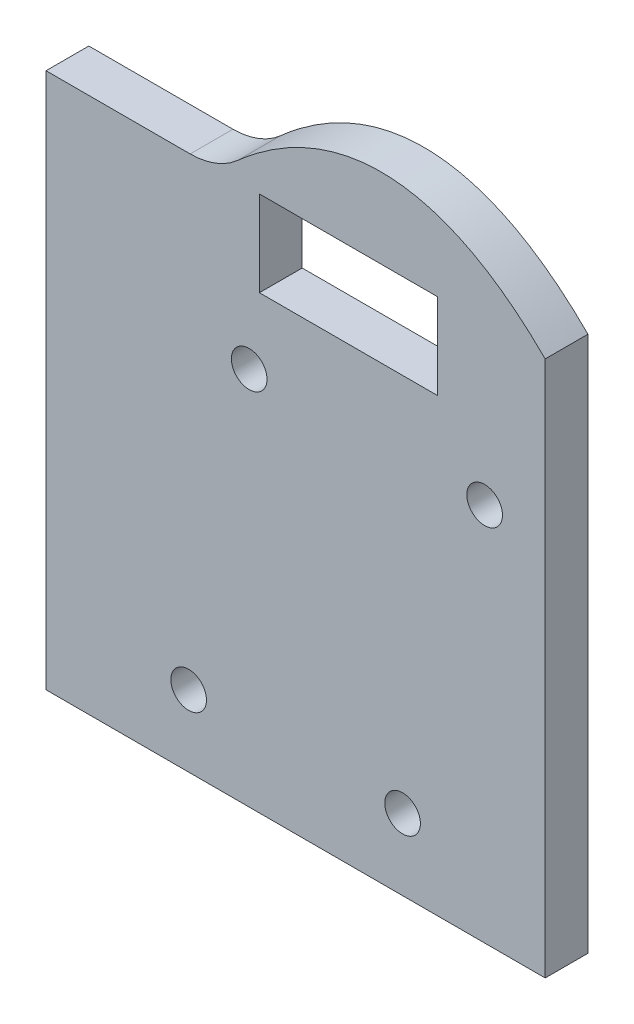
ISO-10303-21;
HEADER;
FILE_DESCRIPTION(('STEP AP214'),'2;1');
FILE_NAME('part.step','',(''),(''),'','','');
FILE_SCHEMA(('AUTOMOTIVE_DESIGN { 1 0 10303 214 1 1 1 1 }'));
ENDSEC;
DATA;
#1=APPLICATION_CONTEXT('core data for automotive mechanical design processes');
#2=APPLICATION_PROTOCOL_DEFINITION('international standard','automotive_design',2000,#1);
#3=PRODUCT_CONTEXT('',#1,'mechanical');
#4=PRODUCT('Part','Part','',(#3));
#5=PRODUCT_RELATED_PRODUCT_CATEGORY('part','',(#4));
#6=PRODUCT_DEFINITION_FORMATION('','',#4);
#7=PRODUCT_DEFINITION_CONTEXT('part definition',#1,'design');
#8=PRODUCT_DEFINITION('design','',#6,#7);
#9=PRODUCT_DEFINITION_SHAPE('','',#8);
#10=(LENGTH_UNIT() NAMED_UNIT(*) SI_UNIT(.MILLI.,.METRE.));
#11=(NAMED_UNIT(*) PLANE_ANGLE_UNIT() SI_UNIT($,.RADIAN.));
#12=(NAMED_UNIT(*) SI_UNIT($,.STERADIAN.) SOLID_ANGLE_UNIT());
#13=UNCERTAINTY_MEASURE_WITH_UNIT(LENGTH_MEASURE(1.E-05),#10,'distance_accuracy_value','');
#14=(GEOMETRIC_REPRESENTATION_CONTEXT(3) GLOBAL_UNCERTAINTY_ASSIGNED_CONTEXT((#13)) GLOBAL_UNIT_ASSIGNED_CONTEXT((#10,
#11,#12)) REPRESENTATION_CONTEXT('',''));
#15=CARTESIAN_POINT('',(0.,0.,0.));
#16=DIRECTION('',(0.,0.,1.));
#17=DIRECTION('',(1.,0.,0.));
#18=AXIS2_PLACEMENT_3D('',#15,#16,#17);
#19=CARTESIAN_POINT('',(-223.622738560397,79.0489904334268,6.));
#20=DIRECTION('',(0.,0.,1.));
#21=DIRECTION('',(1.,0.,0.));
#22=AXIS2_PLACEMENT_3D('',#19,#20,#21);
#23=PLANE('',#22);
#24=CARTESIAN_POINT('',(-243.480623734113,45.8964952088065,6.));
#25=DIRECTION('',(0.,0.,1.));
#26=DIRECTION('',(-1.,0.,0.));
#27=AXIS2_PLACEMENT_3D('',#24,#25,#26);
#28=CIRCLE('',#27,2.5);
#29=CARTESIAN_POINT('',(-245.980623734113,45.8964952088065,6.));
#30=VERTEX_POINT('',#29);
#31=EDGE_CURVE('E143',#30,#30,#28,.T.);
#32=ORIENTED_EDGE('',*,*,#31,.F.);
#33=EDGE_LOOP('',(#32));
#34=FACE_BOUND('',#33,.T.);
#35=CARTESIAN_POINT('',(-251.971314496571,2.69858037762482,6.));
#36=DIRECTION('',(0.,0.,1.));
#37=DIRECTION('',(-1.,0.,0.));
#38=AXIS2_PLACEMENT_3D('',#35,#36,#37);
#39=CIRCLE('',#38,2.49999999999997);
#40=CARTESIAN_POINT('',(-254.47131449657,2.69858037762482,6.));
#41=VERTEX_POINT('',#40);
#42=EDGE_CURVE('E155',#41,#41,#39,.T.);
#43=ORIENTED_EDGE('',*,*,#42,.F.);
#44=EDGE_LOOP('',(#43));
#45=FACE_BOUND('',#44,.T.);
#46=CARTESIAN_POINT('',(-201.971314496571,67.884414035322,6.));
#47=CARTESIAN_POINT('',(-216.079648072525,81.9598671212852,6.));
#48=CARTESIAN_POINT('',(-231.216121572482,82.7413645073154,6.));
#49=CARTESIAN_POINT('',(-245.123285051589,70.4038145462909,6.));
#50=B_SPLINE_CURVE_WITH_KNOTS('',3,(#46,#47,#48,#49),.UNSPECIFIED.,.F.,.F.,(4,4),
(0.0599123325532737,1.),.UNSPECIFIED.);
#51=CARTESIAN_POINT('',(-201.971314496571,67.884414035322,6.));
#52=VERTEX_POINT('',#51);
#53=CARTESIAN_POINT('',(-245.123285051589,70.4038145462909,6.));
#54=VERTEX_POINT('',#53);
#55=EDGE_CURVE('E166',#52,#54,#50,.T.);
#56=ORIENTED_EDGE('',*,*,#55,.T.);
#57=CARTESIAN_POINT('',(-251.759596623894,77.8844140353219,6.));
#58=DIRECTION('',(0.,0.,-1.));
#59=DIRECTION('',(-1.,0.,0.));
#60=AXIS2_PLACEMENT_3D('',#57,#58,#59);
#61=CIRCLE('',#60,9.99999999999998);
#62=CARTESIAN_POINT('',(-251.759596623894,67.8844140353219,6.));
#63=VERTEX_POINT('',#62);
#64=EDGE_CURVE('E172',#54,#63,#61,.T.);
#65=ORIENTED_EDGE('',*,*,#64,.T.);
#66=DIRECTION('',(-1.,0.,0.));
#67=VECTOR('',#66,1.);
#68=CARTESIAN_POINT('',(-271.971290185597,67.884414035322,6.));
#69=LINE('',#68,#67);
#70=CARTESIAN_POINT('',(-271.971290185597,67.884414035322,6.));
#71=VERTEX_POINT('',#70);
#72=EDGE_CURVE('E178',#63,#71,#69,.T.);
#73=ORIENTED_EDGE('',*,*,#72,.T.);
#74=DIRECTION('',(-6.32120893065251E-07,-0.9999999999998,0.));
#75=VECTOR('',#74,1.);
#76=CARTESIAN_POINT('',(-271.971337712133,-7.30141962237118,6.));
#77=LINE('',#76,#75);
#78=CARTESIAN_POINT('',(-271.971337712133,-7.30141962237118,6.));
#79=VERTEX_POINT('',#78);
#80=EDGE_CURVE('E180',#71,#79,#77,.T.);
#81=ORIENTED_EDGE('',*,*,#80,.T.);
#82=DIRECTION('',(1.,0.,0.));
#83=VECTOR('',#82,1.);
#84=CARTESIAN_POINT('',(-201.971314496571,-7.30141962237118,6.));
#85=LINE('',#84,#83);
#86=CARTESIAN_POINT('',(-201.971314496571,-7.30141962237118,6.));
#87=VERTEX_POINT('',#86);
#88=EDGE_CURVE('E182',#79,#87,#85,.T.);
#89=ORIENTED_EDGE('',*,*,#88,.T.);
#90=DIRECTION('',(0.,1.,0.));
#91=VECTOR('',#90,1.);
#92=CARTESIAN_POINT('',(-201.971314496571,67.884414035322,6.));
#93=LINE('',#92,#91);
#94=EDGE_CURVE('E184',#87,#52,#93,.T.);
#95=ORIENTED_EDGE('',*,*,#94,.T.);
#96=EDGE_LOOP('',(#56,#65,#73,#81,#89,#95));
#97=FACE_BOUND('',#96,.T.);
#98=CARTESIAN_POINT('',(-221.971337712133,2.69858037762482,6.));
#99=DIRECTION('',(0.,0.,1.));
#100=DIRECTION('',(1.,0.,0.));
#101=AXIS2_PLACEMENT_3D('',#98,#99,#100);
#102=CIRCLE('',#101,2.5);
#103=CARTESIAN_POINT('',(-219.471337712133,2.69858037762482,6.));
#104=VERTEX_POINT('',#103);
#105=EDGE_CURVE('E161',#104,#104,#102,.T.);
#106=ORIENTED_EDGE('',*,*,#105,.F.);
#107=EDGE_LOOP('',(#106));
#108=FACE_BOUND('',#107,.T.);
#109=CARTESIAN_POINT('',(-210.462051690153,45.8964952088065,6.));
#110=DIRECTION('',(0.,0.,1.));
#111=DIRECTION('',(1.,0.,0.));
#112=AXIS2_PLACEMENT_3D('',#109,#110,#111);
#113=CIRCLE('',#112,2.5);
#114=CARTESIAN_POINT('',(-207.962051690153,45.8964952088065,6.));
#115=VERTEX_POINT('',#114);
#116=EDGE_CURVE('E149',#115,#115,#113,.T.);
#117=ORIENTED_EDGE('',*,*,#116,.F.);
#118=EDGE_LOOP('',(#117));
#119=FACE_BOUND('',#118,.T.);
#120=DIRECTION('',(1.,0.,0.));
#121=VECTOR('',#120,1.);
#122=CARTESIAN_POINT('',(-217.044863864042,55.884414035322,6.));
#123=LINE('',#122,#121);
#124=CARTESIAN_POINT('',(-242.044855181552,55.884414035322,6.));
#125=VERTEX_POINT('',#124);
#126=CARTESIAN_POINT('',(-217.044863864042,55.884414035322,6.));
#127=VERTEX_POINT('',#126);
#128=EDGE_CURVE('E115',#125,#127,#123,.T.);
#129=ORIENTED_EDGE('',*,*,#128,.F.);
#130=DIRECTION('',(0.,-1.,0.));
#131=VECTOR('',#130,1.);
#132=CARTESIAN_POINT('',(-242.044855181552,55.884414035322,6.));
#133=LINE('',#132,#131);
#134=CARTESIAN_POINT('',(-242.044855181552,67.884414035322,6.));
#135=VERTEX_POINT('',#134);
#136=EDGE_CURVE('E107',#135,#125,#133,.T.);
#137=ORIENTED_EDGE('',*,*,#136,.F.);
#138=DIRECTION('',(-1.,0.,0.));
#139=VECTOR('',#138,1.);
#140=CARTESIAN_POINT('',(-242.044855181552,67.884414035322,6.));
#141=LINE('',#140,#139);
#142=CARTESIAN_POINT('',(-217.044863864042,67.884414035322,6.));
#143=VERTEX_POINT('',#142);
#144=EDGE_CURVE('E129',#143,#135,#141,.T.);
#145=ORIENTED_EDGE('',*,*,#144,.F.);
#146=DIRECTION('',(0.,1.,0.));
#147=VECTOR('',#146,1.);
#148=CARTESIAN_POINT('',(-217.044863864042,67.884414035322,6.));
#149=LINE('',#148,#147);
#150=EDGE_CURVE('E127',#127,#143,#149,.T.);
#151=ORIENTED_EDGE('',*,*,#150,.F.);
#152=EDGE_LOOP('',(#129,#137,#145,#151));
#153=FACE_BOUND('',#152,.T.);
#154=ADVANCED_FACE('F29',(#34,#45,#97,#108,#119,#153),#23,.T.);
#155=CARTESIAN_POINT('',(-223.622738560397,79.0489904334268,0.));
#156=DIRECTION('',(0.,0.,1.));
#157=DIRECTION('',(1.,0.,0.));
#158=AXIS2_PLACEMENT_3D('',#155,#156,#157);
#159=PLANE('',#158);
#160=CARTESIAN_POINT('',(-243.480623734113,45.8964952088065,0.));
#161=DIRECTION('',(0.,0.,1.));
#162=DIRECTION('',(-1.,0.,0.));
#163=AXIS2_PLACEMENT_3D('',#160,#161,#162);
#164=CIRCLE('',#163,2.5);
#165=CARTESIAN_POINT('',(-245.980623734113,45.8964952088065,0.));
#166=VERTEX_POINT('',#165);
#167=EDGE_CURVE('E123',#166,#166,#164,.T.);
#168=ORIENTED_EDGE('',*,*,#167,.T.);
#169=EDGE_LOOP('',(#168));
#170=FACE_BOUND('',#169,.T.);
#171=CARTESIAN_POINT('',(-251.971314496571,2.69858037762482,0.));
#172=DIRECTION('',(0.,0.,1.));
#173=DIRECTION('',(-1.,0.,0.));
#174=AXIS2_PLACEMENT_3D('',#171,#172,#173);
#175=CIRCLE('',#174,2.49999999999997);
#176=CARTESIAN_POINT('',(-254.47131449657,2.69858037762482,0.));
#177=VERTEX_POINT('',#176);
#178=EDGE_CURVE('E152',#177,#177,#175,.T.);
#179=ORIENTED_EDGE('',*,*,#178,.T.);
#180=EDGE_LOOP('',(#179));
#181=FACE_BOUND('',#180,.T.);
#182=CARTESIAN_POINT('',(-201.971314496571,67.884414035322,0.));
#183=CARTESIAN_POINT('',(-216.079648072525,81.9598671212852,0.));
#184=CARTESIAN_POINT('',(-231.216121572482,82.7413645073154,0.));
#185=CARTESIAN_POINT('',(-245.123285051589,70.4038145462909,0.));
#186=B_SPLINE_CURVE_WITH_KNOTS('',3,(#182,#183,#184,#185),.UNSPECIFIED.,.F.,.F.,(4,4),
(0.0599123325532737,1.),.UNSPECIFIED.);
#187=CARTESIAN_POINT('',(-201.971314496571,67.884414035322,0.));
#188=VERTEX_POINT('',#187);
#189=CARTESIAN_POINT('',(-245.123285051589,70.4038145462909,0.));
#190=VERTEX_POINT('',#189);
#191=EDGE_CURVE('E164',#188,#190,#186,.T.);
#192=ORIENTED_EDGE('',*,*,#191,.F.);
#193=DIRECTION('',(0.,1.,0.));
#194=VECTOR('',#193,1.);
#195=CARTESIAN_POINT('',(-201.971314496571,67.884414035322,0.));
#196=LINE('',#195,#194);
#197=CARTESIAN_POINT('',(-201.971314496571,-7.30141962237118,0.));
#198=VERTEX_POINT('',#197);
#199=EDGE_CURVE('E173',#198,#188,#196,.T.);
#200=ORIENTED_EDGE('',*,*,#199,.F.);
#201=DIRECTION('',(1.,0.,0.));
#202=VECTOR('',#201,1.);
#203=CARTESIAN_POINT('',(-201.971314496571,-7.30141962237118,0.));
#204=LINE('',#203,#202);
#205=CARTESIAN_POINT('',(-271.971337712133,-7.30141962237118,0.));
#206=VERTEX_POINT('',#205);
#207=EDGE_CURVE('E200',#206,#198,#204,.T.);
#208=ORIENTED_EDGE('',*,*,#207,.F.);
#209=DIRECTION('',(-6.32120893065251E-07,-0.9999999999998,0.));
#210=VECTOR('',#209,1.);
#211=CARTESIAN_POINT('',(-271.971337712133,-7.30141962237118,0.));
#212=LINE('',#211,#210);
#213=CARTESIAN_POINT('',(-271.971290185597,67.884414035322,0.));
#214=VERTEX_POINT('',#213);
#215=EDGE_CURVE('E198',#214,#206,#212,.T.);
#216=ORIENTED_EDGE('',*,*,#215,.F.);
#217=DIRECTION('',(-1.,0.,0.));
#218=VECTOR('',#217,1.);
#219=CARTESIAN_POINT('',(-271.971290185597,67.884414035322,0.));
#220=LINE('',#219,#218);
#221=CARTESIAN_POINT('',(-251.759596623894,67.8844140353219,0.));
#222=VERTEX_POINT('',#221);
#223=EDGE_CURVE('E196',#222,#214,#220,.T.);
#224=ORIENTED_EDGE('',*,*,#223,.F.);
#225=CARTESIAN_POINT('',(-251.759596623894,77.8844140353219,0.));
#226=DIRECTION('',(0.,0.,-1.));
#227=DIRECTION('',(-1.,0.,0.));
#228=AXIS2_PLACEMENT_3D('',#225,#226,#227);
#229=CIRCLE('',#228,9.99999999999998);
#230=EDGE_CURVE('E191',#190,#222,#229,.T.);
#231=ORIENTED_EDGE('',*,*,#230,.F.);
#232=EDGE_LOOP('',(#192,#200,#208,#216,#224,#231));
#233=FACE_BOUND('',#232,.T.);
#234=CARTESIAN_POINT('',(-221.971337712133,2.69858037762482,0.));
#235=DIRECTION('',(0.,0.,1.));
#236=DIRECTION('',(1.,0.,0.));
#237=AXIS2_PLACEMENT_3D('',#234,#235,#236);
#238=CIRCLE('',#237,2.5);
#239=CARTESIAN_POINT('',(-219.471337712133,2.69858037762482,0.));
#240=VERTEX_POINT('',#239);
#241=EDGE_CURVE('E158',#240,#240,#238,.T.);
#242=ORIENTED_EDGE('',*,*,#241,.T.);
#243=EDGE_LOOP('',(#242));
#244=FACE_BOUND('',#243,.T.);
#245=CARTESIAN_POINT('',(-210.462051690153,45.8964952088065,0.));
#246=DIRECTION('',(0.,0.,1.));
#247=DIRECTION('',(1.,0.,0.));
#248=AXIS2_PLACEMENT_3D('',#245,#246,#247);
#249=CIRCLE('',#248,2.5);
#250=CARTESIAN_POINT('',(-207.962051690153,45.8964952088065,0.));
#251=VERTEX_POINT('',#250);
#252=EDGE_CURVE('E146',#251,#251,#249,.T.);
#253=ORIENTED_EDGE('',*,*,#252,.T.);
#254=EDGE_LOOP('',(#253));
#255=FACE_BOUND('',#254,.T.);
#256=DIRECTION('',(0.,-1.,0.));
#257=VECTOR('',#256,1.);
#258=CARTESIAN_POINT('',(-242.044855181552,55.884414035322,0.));
#259=LINE('',#258,#257);
#260=CARTESIAN_POINT('',(-242.044855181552,67.884414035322,0.));
#261=VERTEX_POINT('',#260);
#262=CARTESIAN_POINT('',(-242.044855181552,55.884414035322,0.));
#263=VERTEX_POINT('',#262);
#264=EDGE_CURVE('E53',#261,#263,#259,.T.);
#265=ORIENTED_EDGE('',*,*,#264,.T.);
#266=DIRECTION('',(1.,0.,0.));
#267=VECTOR('',#266,1.);
#268=CARTESIAN_POINT('',(-217.044863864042,55.884414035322,0.));
#269=LINE('',#268,#267);
#270=CARTESIAN_POINT('',(-217.044863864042,55.884414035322,0.));
#271=VERTEX_POINT('',#270);
#272=EDGE_CURVE('E122',#263,#271,#269,.T.);
#273=ORIENTED_EDGE('',*,*,#272,.T.);
#274=DIRECTION('',(0.,1.,0.));
#275=VECTOR('',#274,1.);
#276=CARTESIAN_POINT('',(-217.044863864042,67.884414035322,0.));
#277=LINE('',#276,#275);
#278=CARTESIAN_POINT('',(-217.044863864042,67.884414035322,0.));
#279=VERTEX_POINT('',#278);
#280=EDGE_CURVE('E135',#271,#279,#277,.T.);
#281=ORIENTED_EDGE('',*,*,#280,.T.);
#282=DIRECTION('',(-1.,0.,0.));
#283=VECTOR('',#282,1.);
#284=CARTESIAN_POINT('',(-242.044855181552,67.884414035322,0.));
#285=LINE('',#284,#283);
#286=EDGE_CURVE('E116',#279,#261,#285,.T.);
#287=ORIENTED_EDGE('',*,*,#286,.T.);
#288=EDGE_LOOP('',(#265,#273,#281,#287));
#289=FACE_BOUND('',#288,.T.);
#290=ADVANCED_FACE('F224',(#170,#181,#233,#244,#255,#289),#159,.F.);
#291=DIRECTION('',(0.,0.,-1.));
#292=VECTOR('',#291,1.);
#293=SURFACE_OF_LINEAR_EXTRUSION('',#50,#292);
#294=ORIENTED_EDGE('',*,*,#191,.T.);
#295=DIRECTION('',(0.,0.,-1.));
#296=VECTOR('',#295,1.);
#297=CARTESIAN_POINT('',(-245.123285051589,70.4038145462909,6.));
#298=LINE('',#297,#296);
#299=EDGE_CURVE('E11',#54,#190,#298,.T.);
#300=ORIENTED_EDGE('',*,*,#299,.F.);
#301=ORIENTED_EDGE('',*,*,#55,.F.);
#302=DIRECTION('',(0.,0.,-1.));
#303=VECTOR('',#302,1.);
#304=CARTESIAN_POINT('',(-201.971314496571,67.884414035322,6.));
#305=LINE('',#304,#303);
#306=EDGE_CURVE('E186',#52,#188,#305,.T.);
#307=ORIENTED_EDGE('',*,*,#306,.T.);
#308=EDGE_LOOP('',(#294,#300,#301,#307));
#309=FACE_BOUND('',#308,.T.);
#310=ADVANCED_FACE('F31',(#309),#293,.F.);
#311=CARTESIAN_POINT('',(-251.759596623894,77.8844140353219,6.));
#312=DIRECTION('',(0.,0.,-1.));
#313=DIRECTION('',(-1.,0.,0.));
#314=AXIS2_PLACEMENT_3D('',#311,#312,#313);
#315=CYLINDRICAL_SURFACE('',#314,9.99999999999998);
#316=ORIENTED_EDGE('',*,*,#230,.T.);
#317=DIRECTION('',(0.,0.,-1.));
#318=VECTOR('',#317,1.);
#319=CARTESIAN_POINT('',(-251.759596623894,67.8844140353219,6.));
#320=LINE('',#319,#318);
#321=EDGE_CURVE('E38',#63,#222,#320,.T.);
#322=ORIENTED_EDGE('',*,*,#321,.F.);
#323=ORIENTED_EDGE('',*,*,#64,.F.);
#324=ORIENTED_EDGE('',*,*,#299,.T.);
#325=EDGE_LOOP('',(#316,#322,#323,#324));
#326=FACE_BOUND('',#325,.T.);
#327=ADVANCED_FACE('F242',(#326),#315,.F.);
#328=CARTESIAN_POINT('',(-271.971290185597,67.884414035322,6.));
#329=DIRECTION('',(0.,-1.,0.));
#330=DIRECTION('',(1.,0.,0.));
#331=AXIS2_PLACEMENT_3D('',#328,#329,#330);
#332=PLANE('',#331);
#333=ORIENTED_EDGE('',*,*,#223,.T.);
#334=DIRECTION('',(0.,0.,-1.));
#335=VECTOR('',#334,1.);
#336=CARTESIAN_POINT('',(-271.971290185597,67.884414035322,6.));
#337=LINE('',#336,#335);
#338=EDGE_CURVE('E211',#71,#214,#337,.T.);
#339=ORIENTED_EDGE('',*,*,#338,.F.);
#340=ORIENTED_EDGE('',*,*,#72,.F.);
#341=ORIENTED_EDGE('',*,*,#321,.T.);
#342=EDGE_LOOP('',(#333,#339,#340,#341));
#343=FACE_BOUND('',#342,.T.);
#344=ADVANCED_FACE('F218',(#343),#332,.F.);
#345=CARTESIAN_POINT('',(-271.971337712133,-7.30141962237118,6.));
#346=DIRECTION('',(0.9999999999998,-6.32120893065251E-07,0.));
#347=DIRECTION('',(6.32120893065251E-07,0.9999999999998,0.));
#348=AXIS2_PLACEMENT_3D('',#345,#346,#347);
#349=PLANE('',#348);
#350=ORIENTED_EDGE('',*,*,#215,.T.);
#351=DIRECTION('',(0.,0.,-1.));
#352=VECTOR('',#351,1.);
#353=CARTESIAN_POINT('',(-271.971337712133,-7.30141962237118,6.));
#354=LINE('',#353,#352);
#355=EDGE_CURVE('E208',#79,#206,#354,.T.);
#356=ORIENTED_EDGE('',*,*,#355,.F.);
#357=ORIENTED_EDGE('',*,*,#80,.F.);
#358=ORIENTED_EDGE('',*,*,#338,.T.);
#359=EDGE_LOOP('',(#350,#356,#357,#358));
#360=FACE_BOUND('',#359,.T.);
#361=ADVANCED_FACE('F230',(#360),#349,.F.);
#362=CARTESIAN_POINT('',(-201.971314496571,-7.30141962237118,6.));
#363=DIRECTION('',(0.,1.,0.));
#364=DIRECTION('',(-1.,0.,0.));
#365=AXIS2_PLACEMENT_3D('',#362,#363,#364);
#366=PLANE('',#365);
#367=ORIENTED_EDGE('',*,*,#207,.T.);
#368=DIRECTION('',(0.,0.,-1.));
#369=VECTOR('',#368,1.);
#370=CARTESIAN_POINT('',(-201.971314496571,-7.30141962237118,6.));
#371=LINE('',#370,#369);
#372=EDGE_CURVE('E205',#87,#198,#371,.T.);
#373=ORIENTED_EDGE('',*,*,#372,.F.);
#374=ORIENTED_EDGE('',*,*,#88,.F.);
#375=ORIENTED_EDGE('',*,*,#355,.T.);
#376=EDGE_LOOP('',(#367,#373,#374,#375));
#377=FACE_BOUND('',#376,.T.);
#378=ADVANCED_FACE('F234',(#377),#366,.F.);
#379=CARTESIAN_POINT('',(-201.971314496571,67.884414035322,6.));
#380=DIRECTION('',(-1.,0.,0.));
#381=DIRECTION('',(0.,-1.,0.));
#382=AXIS2_PLACEMENT_3D('',#379,#380,#381);
#383=PLANE('',#382);
#384=ORIENTED_EDGE('',*,*,#199,.T.);
#385=ORIENTED_EDGE('',*,*,#306,.F.);
#386=ORIENTED_EDGE('',*,*,#94,.F.);
#387=ORIENTED_EDGE('',*,*,#372,.T.);
#388=EDGE_LOOP('',(#384,#385,#386,#387));
#389=FACE_BOUND('',#388,.T.);
#390=ADVANCED_FACE('F245',(#389),#383,.F.);
#391=CARTESIAN_POINT('',(-221.971337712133,2.69858037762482,6.));
#392=DIRECTION('',(0.,0.,-1.));
#393=DIRECTION('',(-1.,0.,0.));
#394=AXIS2_PLACEMENT_3D('',#391,#392,#393);
#395=CYLINDRICAL_SURFACE('',#394,2.5);
#396=ORIENTED_EDGE('',*,*,#105,.T.);
#397=EDGE_LOOP('',(#396));
#398=FACE_BOUND('',#397,.T.);
#399=ORIENTED_EDGE('',*,*,#241,.F.);
#400=EDGE_LOOP('',(#399));
#401=FACE_BOUND('',#400,.T.);
#402=ADVANCED_FACE('F247',(#398,#401),#395,.F.);
#403=CARTESIAN_POINT('',(-251.971314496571,2.69858037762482,6.));
#404=DIRECTION('',(0.,0.,-1.));
#405=DIRECTION('',(-1.,0.,0.));
#406=AXIS2_PLACEMENT_3D('',#403,#404,#405);
#407=CYLINDRICAL_SURFACE('',#406,2.49999999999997);
#408=ORIENTED_EDGE('',*,*,#42,.T.);
#409=EDGE_LOOP('',(#408));
#410=FACE_BOUND('',#409,.T.);
#411=ORIENTED_EDGE('',*,*,#178,.F.);
#412=EDGE_LOOP('',(#411));
#413=FACE_BOUND('',#412,.T.);
#414=ADVANCED_FACE('F253',(#410,#413),#407,.F.);
#415=CARTESIAN_POINT('',(-210.462051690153,45.8964952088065,6.));
#416=DIRECTION('',(0.,0.,-1.));
#417=DIRECTION('',(-1.,0.,0.));
#418=AXIS2_PLACEMENT_3D('',#415,#416,#417);
#419=CYLINDRICAL_SURFACE('',#418,2.5);
#420=ORIENTED_EDGE('',*,*,#116,.T.);
#421=EDGE_LOOP('',(#420));
#422=FACE_BOUND('',#421,.T.);
#423=ORIENTED_EDGE('',*,*,#252,.F.);
#424=EDGE_LOOP('',(#423));
#425=FACE_BOUND('',#424,.T.);
#426=ADVANCED_FACE('F270',(#422,#425),#419,.F.);
#427=CARTESIAN_POINT('',(-243.480623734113,45.8964952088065,6.));
#428=DIRECTION('',(0.,0.,-1.));
#429=DIRECTION('',(-1.,0.,0.));
#430=AXIS2_PLACEMENT_3D('',#427,#428,#429);
#431=CYLINDRICAL_SURFACE('',#430,2.5);
#432=ORIENTED_EDGE('',*,*,#31,.T.);
#433=EDGE_LOOP('',(#432));
#434=FACE_BOUND('',#433,.T.);
#435=ORIENTED_EDGE('',*,*,#167,.F.);
#436=EDGE_LOOP('',(#435));
#437=FACE_BOUND('',#436,.T.);
#438=ADVANCED_FACE('F274',(#434,#437),#431,.F.);
#439=CARTESIAN_POINT('',(-242.044855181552,55.884414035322,6.));
#440=DIRECTION('',(1.,0.,0.));
#441=DIRECTION('',(0.,0.,-1.));
#442=AXIS2_PLACEMENT_3D('',#439,#440,#441);
#443=PLANE('',#442);
#444=ORIENTED_EDGE('',*,*,#264,.F.);
#445=DIRECTION('',(0.,0.,-1.));
#446=VECTOR('',#445,1.);
#447=CARTESIAN_POINT('',(-242.044855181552,67.884414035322,6.));
#448=LINE('',#447,#446);
#449=EDGE_CURVE('E111',#135,#261,#448,.T.);
#450=ORIENTED_EDGE('',*,*,#449,.F.);
#451=ORIENTED_EDGE('',*,*,#136,.T.);
#452=DIRECTION('',(0.,0.,-1.));
#453=VECTOR('',#452,1.);
#454=CARTESIAN_POINT('',(-242.044855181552,55.884414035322,6.));
#455=LINE('',#454,#453);
#456=EDGE_CURVE('E110',#125,#263,#455,.T.);
#457=ORIENTED_EDGE('',*,*,#456,.T.);
#458=EDGE_LOOP('',(#444,#450,#451,#457));
#459=FACE_BOUND('',#458,.T.);
#460=ADVANCED_FACE('F109',(#459),#443,.T.);
#461=CARTESIAN_POINT('',(-217.044863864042,55.884414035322,6.));
#462=DIRECTION('',(0.,1.,0.));
#463=DIRECTION('',(0.,0.,1.));
#464=AXIS2_PLACEMENT_3D('',#461,#462,#463);
#465=PLANE('',#464);
#466=ORIENTED_EDGE('',*,*,#272,.F.);
#467=ORIENTED_EDGE('',*,*,#456,.F.);
#468=ORIENTED_EDGE('',*,*,#128,.T.);
#469=DIRECTION('',(0.,0.,-1.));
#470=VECTOR('',#469,1.);
#471=CARTESIAN_POINT('',(-217.044863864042,55.884414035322,6.));
#472=LINE('',#471,#470);
#473=EDGE_CURVE('E124',#127,#271,#472,.T.);
#474=ORIENTED_EDGE('',*,*,#473,.T.);
#475=EDGE_LOOP('',(#466,#467,#468,#474));
#476=FACE_BOUND('',#475,.T.);
#477=ADVANCED_FACE('F119',(#476),#465,.T.);
#478=CARTESIAN_POINT('',(-217.044863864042,67.884414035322,6.));
#479=DIRECTION('',(-1.,0.,0.));
#480=DIRECTION('',(0.,0.,1.));
#481=AXIS2_PLACEMENT_3D('',#478,#479,#480);
#482=PLANE('',#481);
#483=ORIENTED_EDGE('',*,*,#280,.F.);
#484=ORIENTED_EDGE('',*,*,#473,.F.);
#485=ORIENTED_EDGE('',*,*,#150,.T.);
#486=DIRECTION('',(0.,0.,-1.));
#487=VECTOR('',#486,1.);
#488=CARTESIAN_POINT('',(-217.044863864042,67.884414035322,6.));
#489=LINE('',#488,#487);
#490=EDGE_CURVE('E45',#143,#279,#489,.T.);
#491=ORIENTED_EDGE('',*,*,#490,.T.);
#492=EDGE_LOOP('',(#483,#484,#485,#491));
#493=FACE_BOUND('',#492,.T.);
#494=ADVANCED_FACE('F283',(#493),#482,.T.);
#495=CARTESIAN_POINT('',(-242.044855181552,67.884414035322,6.));
#496=DIRECTION('',(0.,-1.,0.));
#497=DIRECTION('',(0.,0.,-1.));
#498=AXIS2_PLACEMENT_3D('',#495,#496,#497);
#499=PLANE('',#498);
#500=ORIENTED_EDGE('',*,*,#286,.F.);
#501=ORIENTED_EDGE('',*,*,#490,.F.);
#502=ORIENTED_EDGE('',*,*,#144,.T.);
#503=ORIENTED_EDGE('',*,*,#449,.T.);
#504=EDGE_LOOP('',(#500,#501,#502,#503));
#505=FACE_BOUND('',#504,.T.);
#506=ADVANCED_FACE('F286',(#505),#499,.T.);
#507=CLOSED_SHELL('',(#154,#290,#310,#327,#344,#361,#378,#390,#402,#414,#426,#438,#460,#477,
#494,#506));
#508=MANIFOLD_SOLID_BREP('B2',#507);
#509=ADVANCED_BREP_SHAPE_REPRESENTATION('',(#18,#508),#14);
#510=SHAPE_DEFINITION_REPRESENTATION(#9,#509);
ENDSEC;
END-ISO-10303-21;
